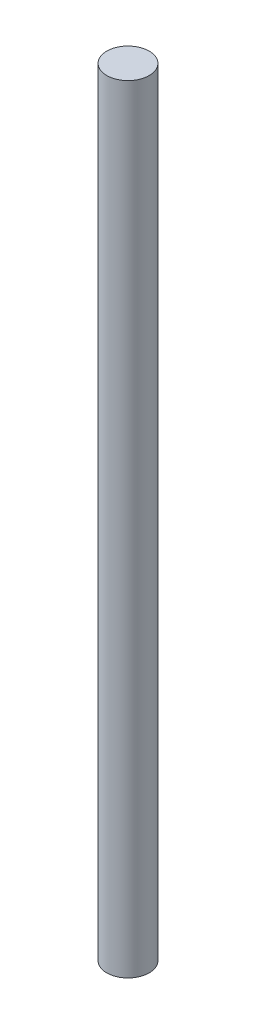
from build123d import *

# Parameters (mm, degrees)
ESQUISSE1_R      = 3
EXTRUSION1_DEPTH = 110


with BuildPart() as part:
    # Esquisse1 → Extrusion1 (new body)
    with BuildSketch(Plane(origin=(0, 0, 0), x_dir=(1, 0, 0), z_dir=(0, 1, 0))):
        with Locations(Location((0, 0, 0), (0, 0, 270))):
            Circle(ESQUISSE1_R)
    extrude(amount=EXTRUSION1_DEPTH)


solid = part.part
